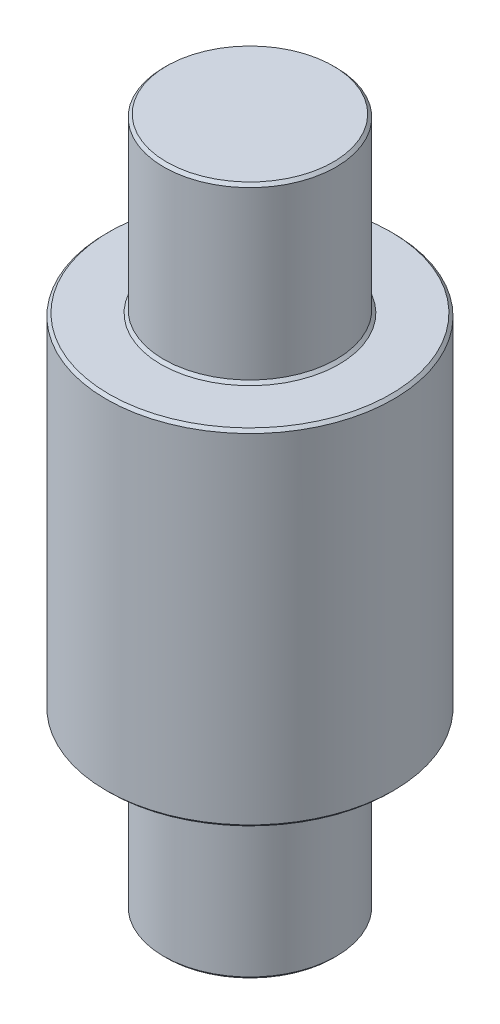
ISO-10303-21;
HEADER;
FILE_DESCRIPTION(('STEP AP214'),'2;1');
FILE_NAME('part.step','',(''),(''),'','','');
FILE_SCHEMA(('AUTOMOTIVE_DESIGN { 1 0 10303 214 1 1 1 1 }'));
ENDSEC;
DATA;
#1=APPLICATION_CONTEXT('core data for automotive mechanical design processes');
#2=APPLICATION_PROTOCOL_DEFINITION('international standard','automotive_design',2000,#1);
#3=PRODUCT_CONTEXT('',#1,'mechanical');
#4=PRODUCT('Part','Part','',(#3));
#5=PRODUCT_RELATED_PRODUCT_CATEGORY('part','',(#4));
#6=PRODUCT_DEFINITION_FORMATION('','',#4);
#7=PRODUCT_DEFINITION_CONTEXT('part definition',#1,'design');
#8=PRODUCT_DEFINITION('design','',#6,#7);
#9=PRODUCT_DEFINITION_SHAPE('','',#8);
#10=(LENGTH_UNIT() NAMED_UNIT(*) SI_UNIT(.MILLI.,.METRE.));
#11=(NAMED_UNIT(*) PLANE_ANGLE_UNIT() SI_UNIT($,.RADIAN.));
#12=(NAMED_UNIT(*) SI_UNIT($,.STERADIAN.) SOLID_ANGLE_UNIT());
#13=UNCERTAINTY_MEASURE_WITH_UNIT(LENGTH_MEASURE(1.E-05),#10,'distance_accuracy_value','');
#14=(GEOMETRIC_REPRESENTATION_CONTEXT(3) GLOBAL_UNCERTAINTY_ASSIGNED_CONTEXT((#13)) GLOBAL_UNIT_ASSIGNED_CONTEXT((#10,
#11,#12)) REPRESENTATION_CONTEXT('',''));
#15=CARTESIAN_POINT('',(0.,0.,0.));
#16=DIRECTION('',(0.,0.,1.));
#17=DIRECTION('',(1.,0.,0.));
#18=AXIS2_PLACEMENT_3D('',#15,#16,#17);
#19=CARTESIAN_POINT('',(0.,60.,0.));
#20=DIRECTION('',(0.,1.,0.));
#21=DIRECTION('',(0.,0.,1.));
#22=AXIS2_PLACEMENT_3D('',#19,#20,#21);
#23=PLANE('',#22);
#24=CARTESIAN_POINT('',(0.,60.,0.));
#25=DIRECTION('',(0.,1.,0.));
#26=DIRECTION('',(0.,0.,1.));
#27=AXIS2_PLACEMENT_3D('',#24,#25,#26);
#28=CIRCLE('',#27,14.5);
#29=CARTESIAN_POINT('',(0.,60.,14.5));
#30=VERTEX_POINT('',#29);
#31=EDGE_CURVE('E40',#30,#30,#28,.T.);
#32=ORIENTED_EDGE('',*,*,#31,.T.);
#33=EDGE_LOOP('',(#32));
#34=FACE_BOUND('',#33,.T.);
#35=ADVANCED_FACE('F29',(#34),#23,.T.);
#36=CARTESIAN_POINT('',(0.,60.,0.));
#37=DIRECTION('',(0.,1.,0.));
#38=DIRECTION('',(0.,0.,1.));
#39=AXIS2_PLACEMENT_3D('',#36,#37,#38);
#40=CYLINDRICAL_SURFACE('',#39,15.);
#41=CARTESIAN_POINT('',(0.,59.5,0.));
#42=DIRECTION('',(0.,1.,0.));
#43=DIRECTION('',(0.,0.,1.));
#44=AXIS2_PLACEMENT_3D('',#41,#42,#43);
#45=CIRCLE('',#44,15.);
#46=CARTESIAN_POINT('',(0.,59.5,15.));
#47=VERTEX_POINT('',#46);
#48=EDGE_CURVE('E10',#47,#47,#45,.F.);
#49=ORIENTED_EDGE('',*,*,#48,.T.);
#50=EDGE_LOOP('',(#49));
#51=FACE_BOUND('',#50,.T.);
#52=CARTESIAN_POINT('',(0.,30.5,0.));
#53=DIRECTION('',(0.,1.,0.));
#54=DIRECTION('',(0.,0.,1.));
#55=AXIS2_PLACEMENT_3D('',#52,#53,#54);
#56=CIRCLE('',#55,15.);
#57=CARTESIAN_POINT('',(0.,30.5,15.));
#58=VERTEX_POINT('',#57);
#59=EDGE_CURVE('E36',#58,#58,#56,.T.);
#60=ORIENTED_EDGE('',*,*,#59,.T.);
#61=EDGE_LOOP('',(#60));
#62=FACE_BOUND('',#61,.T.);
#63=ADVANCED_FACE('F85',(#51,#62),#40,.T.);
#64=CARTESIAN_POINT('',(-15.,30.,0.));
#65=DIRECTION('',(0.,1.,0.));
#66=DIRECTION('',(0.,0.,1.));
#67=AXIS2_PLACEMENT_3D('',#64,#65,#66);
#68=PLANE('',#67);
#69=CARTESIAN_POINT('',(0.,30.,0.));
#70=DIRECTION('',(0.,1.,0.));
#71=DIRECTION('',(0.,0.,1.));
#72=AXIS2_PLACEMENT_3D('',#69,#70,#71);
#73=CIRCLE('',#72,24.5);
#74=CARTESIAN_POINT('',(0.,30.,24.5));
#75=VERTEX_POINT('',#74);
#76=EDGE_CURVE('E67',#75,#75,#73,.T.);
#77=ORIENTED_EDGE('',*,*,#76,.T.);
#78=EDGE_LOOP('',(#77));
#79=FACE_BOUND('',#78,.T.);
#80=CARTESIAN_POINT('',(0.,30.,0.));
#81=DIRECTION('',(0.,1.,0.));
#82=DIRECTION('',(0.,0.,1.));
#83=AXIS2_PLACEMENT_3D('',#80,#81,#82);
#84=CIRCLE('',#83,15.5);
#85=CARTESIAN_POINT('',(0.,30.,15.5));
#86=VERTEX_POINT('',#85);
#87=EDGE_CURVE('E70',#86,#86,#84,.F.);
#88=ORIENTED_EDGE('',*,*,#87,.T.);
#89=EDGE_LOOP('',(#88));
#90=FACE_BOUND('',#89,.T.);
#91=ADVANCED_FACE('F74',(#79,#90),#68,.T.);
#92=CARTESIAN_POINT('',(0.,60.,0.));
#93=DIRECTION('',(0.,1.,0.));
#94=DIRECTION('',(0.,0.,1.));
#95=AXIS2_PLACEMENT_3D('',#92,#93,#94);
#96=CYLINDRICAL_SURFACE('',#95,25.);
#97=CARTESIAN_POINT('',(0.,29.5,0.));
#98=DIRECTION('',(0.,1.,0.));
#99=DIRECTION('',(0.,0.,1.));
#100=AXIS2_PLACEMENT_3D('',#97,#98,#99);
#101=CIRCLE('',#100,25.);
#102=CARTESIAN_POINT('',(0.,29.5,25.));
#103=VERTEX_POINT('',#102);
#104=EDGE_CURVE('E61',#103,#103,#101,.F.);
#105=ORIENTED_EDGE('',*,*,#104,.T.);
#106=EDGE_LOOP('',(#105));
#107=FACE_BOUND('',#106,.T.);
#108=CARTESIAN_POINT('',(0.,-29.5,0.));
#109=DIRECTION('',(0.,-1.,0.));
#110=DIRECTION('',(0.,0.,-1.));
#111=AXIS2_PLACEMENT_3D('',#108,#109,#110);
#112=CIRCLE('',#111,25.);
#113=CARTESIAN_POINT('',(0.,-29.5,-25.));
#114=VERTEX_POINT('',#113);
#115=EDGE_CURVE('E64',#114,#114,#112,.F.);
#116=ORIENTED_EDGE('',*,*,#115,.T.);
#117=EDGE_LOOP('',(#116));
#118=FACE_BOUND('',#117,.T.);
#119=ADVANCED_FACE('F126',(#107,#118),#96,.T.);
#120=CARTESIAN_POINT('',(-25.,-30.,0.));
#121=DIRECTION('',(0.,-1.,0.));
#122=DIRECTION('',(0.,0.,-1.));
#123=AXIS2_PLACEMENT_3D('',#120,#121,#122);
#124=PLANE('',#123);
#125=CARTESIAN_POINT('',(0.,-30.,0.));
#126=DIRECTION('',(0.,-1.,0.));
#127=DIRECTION('',(0.,0.,-1.));
#128=AXIS2_PLACEMENT_3D('',#125,#126,#127);
#129=CIRCLE('',#128,24.5);
#130=CARTESIAN_POINT('',(0.,-30.,-24.5));
#131=VERTEX_POINT('',#130);
#132=EDGE_CURVE('E55',#131,#131,#129,.T.);
#133=ORIENTED_EDGE('',*,*,#132,.T.);
#134=EDGE_LOOP('',(#133));
#135=FACE_BOUND('',#134,.T.);
#136=CARTESIAN_POINT('',(0.,-30.,0.));
#137=DIRECTION('',(0.,-1.,0.));
#138=DIRECTION('',(0.,0.,-1.));
#139=AXIS2_PLACEMENT_3D('',#136,#137,#138);
#140=CIRCLE('',#139,15.5);
#141=CARTESIAN_POINT('',(0.,-30.,-15.5));
#142=VERTEX_POINT('',#141);
#143=EDGE_CURVE('E58',#142,#142,#140,.F.);
#144=ORIENTED_EDGE('',*,*,#143,.T.);
#145=EDGE_LOOP('',(#144));
#146=FACE_BOUND('',#145,.T.);
#147=ADVANCED_FACE('F117',(#135,#146),#124,.T.);
#148=CARTESIAN_POINT('',(0.,60.,0.));
#149=DIRECTION('',(0.,1.,0.));
#150=DIRECTION('',(0.,0.,1.));
#151=AXIS2_PLACEMENT_3D('',#148,#149,#150);
#152=CYLINDRICAL_SURFACE('',#151,15.);
#153=CARTESIAN_POINT('',(0.,-30.5,0.));
#154=DIRECTION('',(0.,-1.,0.));
#155=DIRECTION('',(0.,0.,-1.));
#156=AXIS2_PLACEMENT_3D('',#153,#154,#155);
#157=CIRCLE('',#156,15.);
#158=CARTESIAN_POINT('',(0.,-30.5,-15.));
#159=VERTEX_POINT('',#158);
#160=EDGE_CURVE('E49',#159,#159,#157,.T.);
#161=ORIENTED_EDGE('',*,*,#160,.T.);
#162=EDGE_LOOP('',(#161));
#163=FACE_BOUND('',#162,.T.);
#164=CARTESIAN_POINT('',(0.,-59.5,0.));
#165=DIRECTION('',(0.,-1.,0.));
#166=DIRECTION('',(0.,0.,-1.));
#167=AXIS2_PLACEMENT_3D('',#164,#165,#166);
#168=CIRCLE('',#167,15.);
#169=CARTESIAN_POINT('',(0.,-59.5,-15.));
#170=VERTEX_POINT('',#169);
#171=EDGE_CURVE('E52',#170,#170,#168,.F.);
#172=ORIENTED_EDGE('',*,*,#171,.T.);
#173=EDGE_LOOP('',(#172));
#174=FACE_BOUND('',#173,.T.);
#175=ADVANCED_FACE('F115',(#163,#174),#152,.T.);
#176=CARTESIAN_POINT('',(-15.,-60.,0.));
#177=DIRECTION('',(0.,-1.,0.));
#178=DIRECTION('',(0.,0.,-1.));
#179=AXIS2_PLACEMENT_3D('',#176,#177,#178);
#180=PLANE('',#179);
#181=CARTESIAN_POINT('',(0.,-60.,0.));
#182=DIRECTION('',(0.,-1.,0.));
#183=DIRECTION('',(0.,0.,-1.));
#184=AXIS2_PLACEMENT_3D('',#181,#182,#183);
#185=CIRCLE('',#184,14.5);
#186=CARTESIAN_POINT('',(0.,-60.,-14.5));
#187=VERTEX_POINT('',#186);
#188=EDGE_CURVE('E44',#187,#187,#185,.T.);
#189=ORIENTED_EDGE('',*,*,#188,.T.);
#190=EDGE_LOOP('',(#189));
#191=FACE_BOUND('',#190,.T.);
#192=ADVANCED_FACE('F98',(#191),#180,.T.);
#193=CARTESIAN_POINT('',(0.,30.,0.));
#194=DIRECTION('',(0.,-1.,0.));
#195=DIRECTION('',(0.,0.,-1.));
#196=AXIS2_PLACEMENT_3D('',#193,#194,#195);
#197=CONICAL_SURFACE('',#196,24.5,0.785398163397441);
#198=ORIENTED_EDGE('',*,*,#104,.F.);
#199=EDGE_LOOP('',(#198));
#200=FACE_BOUND('',#199,.T.);
#201=ORIENTED_EDGE('',*,*,#76,.F.);
#202=EDGE_LOOP('',(#201));
#203=FACE_BOUND('',#202,.T.);
#204=ADVANCED_FACE('F94',(#200,#203),#197,.T.);
#205=CARTESIAN_POINT('',(0.,-29.5,0.));
#206=DIRECTION('',(0.,1.,0.));
#207=DIRECTION('',(0.,0.,1.));
#208=AXIS2_PLACEMENT_3D('',#205,#206,#207);
#209=CONICAL_SURFACE('',#208,25.,0.785398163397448);
#210=ORIENTED_EDGE('',*,*,#132,.F.);
#211=EDGE_LOOP('',(#210));
#212=FACE_BOUND('',#211,.T.);
#213=ORIENTED_EDGE('',*,*,#115,.F.);
#214=EDGE_LOOP('',(#213));
#215=FACE_BOUND('',#214,.T.);
#216=ADVANCED_FACE('F97',(#212,#215),#209,.T.);
#217=CARTESIAN_POINT('',(0.,-30.,0.));
#218=DIRECTION('',(0.,1.,0.));
#219=DIRECTION('',(0.,0.,1.));
#220=AXIS2_PLACEMENT_3D('',#217,#218,#219);
#221=CONICAL_SURFACE('',#220,15.5,0.785398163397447);
#222=ORIENTED_EDGE('',*,*,#160,.F.);
#223=EDGE_LOOP('',(#222));
#224=FACE_BOUND('',#223,.T.);
#225=ORIENTED_EDGE('',*,*,#143,.F.);
#226=EDGE_LOOP('',(#225));
#227=FACE_BOUND('',#226,.T.);
#228=ADVANCED_FACE('F102',(#224,#227),#221,.T.);
#229=CARTESIAN_POINT('',(0.,-59.5,0.));
#230=DIRECTION('',(0.,1.,0.));
#231=DIRECTION('',(0.,0.,1.));
#232=AXIS2_PLACEMENT_3D('',#229,#230,#231);
#233=CONICAL_SURFACE('',#232,15.,0.785398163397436);
#234=ORIENTED_EDGE('',*,*,#188,.F.);
#235=EDGE_LOOP('',(#234));
#236=FACE_BOUND('',#235,.T.);
#237=ORIENTED_EDGE('',*,*,#171,.F.);
#238=EDGE_LOOP('',(#237));
#239=FACE_BOUND('',#238,.T.);
#240=ADVANCED_FACE('F82',(#236,#239),#233,.T.);
#241=CARTESIAN_POINT('',(0.,60.,0.));
#242=DIRECTION('',(0.,-1.,0.));
#243=DIRECTION('',(0.,0.,-1.));
#244=AXIS2_PLACEMENT_3D('',#241,#242,#243);
#245=CONICAL_SURFACE('',#244,14.5,0.785398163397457);
#246=ORIENTED_EDGE('',*,*,#48,.F.);
#247=EDGE_LOOP('',(#246));
#248=FACE_BOUND('',#247,.T.);
#249=ORIENTED_EDGE('',*,*,#31,.F.);
#250=EDGE_LOOP('',(#249));
#251=FACE_BOUND('',#250,.T.);
#252=ADVANCED_FACE('F78',(#248,#251),#245,.T.);
#253=CARTESIAN_POINT('',(0.,30.5,0.));
#254=DIRECTION('',(0.,-1.,0.));
#255=DIRECTION('',(0.,0.,-1.));
#256=AXIS2_PLACEMENT_3D('',#253,#254,#255);
#257=CONICAL_SURFACE('',#256,15.,0.785398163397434);
#258=ORIENTED_EDGE('',*,*,#87,.F.);
#259=EDGE_LOOP('',(#258));
#260=FACE_BOUND('',#259,.T.);
#261=ORIENTED_EDGE('',*,*,#59,.F.);
#262=EDGE_LOOP('',(#261));
#263=FACE_BOUND('',#262,.T.);
#264=ADVANCED_FACE('F31',(#260,#263),#257,.T.);
#265=CLOSED_SHELL('',(#35,#63,#91,#119,#147,#175,#192,#204,#216,#228,#240,#252,#264));
#266=MANIFOLD_SOLID_BREP('B2',#265);
#267=ADVANCED_BREP_SHAPE_REPRESENTATION('',(#18,#266),#14);
#268=SHAPE_DEFINITION_REPRESENTATION(#9,#267);
ENDSEC;
END-ISO-10303-21;
